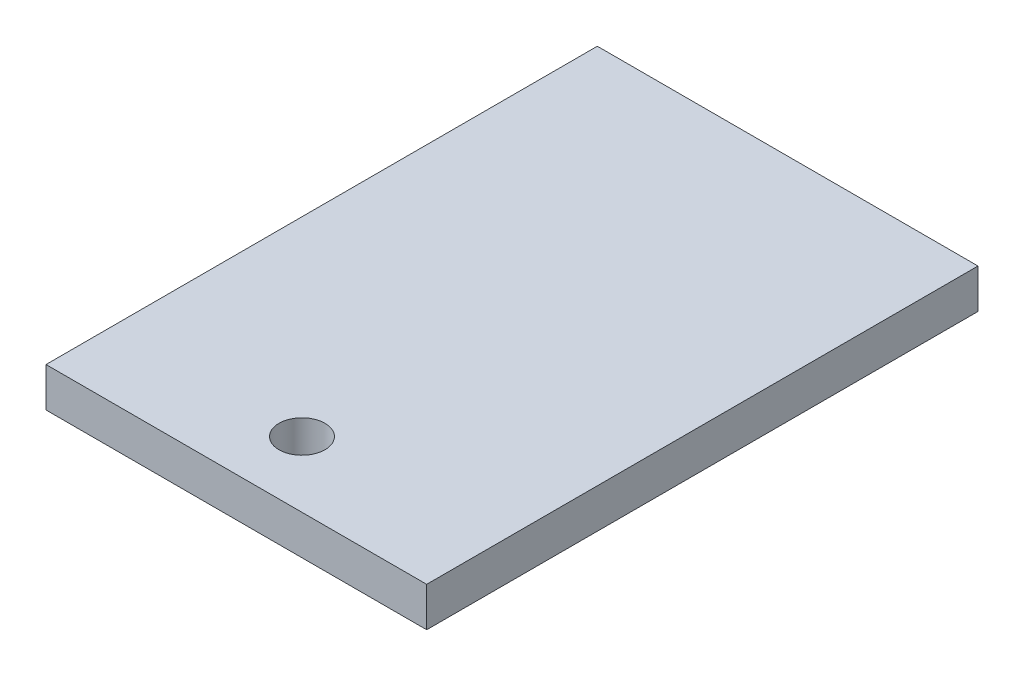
ISO-10303-21;
HEADER;
FILE_DESCRIPTION(('STEP AP214'),'2;1');
FILE_NAME('part.step','',(''),(''),'','','');
FILE_SCHEMA(('AUTOMOTIVE_DESIGN { 1 0 10303 214 1 1 1 1 }'));
ENDSEC;
DATA;
#1=APPLICATION_CONTEXT('core data for automotive mechanical design processes');
#2=APPLICATION_PROTOCOL_DEFINITION('international standard','automotive_design',2000,#1);
#3=PRODUCT_CONTEXT('',#1,'mechanical');
#4=PRODUCT('Part','Part','',(#3));
#5=PRODUCT_RELATED_PRODUCT_CATEGORY('part','',(#4));
#6=PRODUCT_DEFINITION_FORMATION('','',#4);
#7=PRODUCT_DEFINITION_CONTEXT('part definition',#1,'design');
#8=PRODUCT_DEFINITION('design','',#6,#7);
#9=PRODUCT_DEFINITION_SHAPE('','',#8);
#10=(LENGTH_UNIT() NAMED_UNIT(*) SI_UNIT(.MILLI.,.METRE.));
#11=(NAMED_UNIT(*) PLANE_ANGLE_UNIT() SI_UNIT($,.RADIAN.));
#12=(NAMED_UNIT(*) SI_UNIT($,.STERADIAN.) SOLID_ANGLE_UNIT());
#13=UNCERTAINTY_MEASURE_WITH_UNIT(LENGTH_MEASURE(1.E-05),#10,'distance_accuracy_value','');
#14=(GEOMETRIC_REPRESENTATION_CONTEXT(3) GLOBAL_UNCERTAINTY_ASSIGNED_CONTEXT((#13)) GLOBAL_UNIT_ASSIGNED_CONTEXT((#10,
#11,#12)) REPRESENTATION_CONTEXT('',''));
#15=CARTESIAN_POINT('',(0.,0.,0.));
#16=DIRECTION('',(0.,0.,1.));
#17=DIRECTION('',(1.,0.,0.));
#18=AXIS2_PLACEMENT_3D('',#15,#16,#17);
#19=CARTESIAN_POINT('',(0.,3.,-42.));
#20=DIRECTION('',(0.,-1.,0.));
#21=DIRECTION('',(0.,0.,-1.));
#22=AXIS2_PLACEMENT_3D('',#19,#20,#21);
#23=PLANE('',#22);
#24=DIRECTION('',(0.,0.,1.));
#25=VECTOR('',#24,1.);
#26=CARTESIAN_POINT('',(0.,3.,0.));
#27=LINE('',#26,#25);
#28=CARTESIAN_POINT('',(0.,3.,-42.));
#29=VERTEX_POINT('',#28);
#30=CARTESIAN_POINT('',(0.,3.,0.));
#31=VERTEX_POINT('',#30);
#32=EDGE_CURVE('E99',#29,#31,#27,.T.);
#33=ORIENTED_EDGE('',*,*,#32,.T.);
#34=DIRECTION('',(1.,0.,0.));
#35=VECTOR('',#34,1.);
#36=CARTESIAN_POINT('',(0.,3.,0.));
#37=LINE('',#36,#35);
#38=CARTESIAN_POINT('',(29.,3.,0.));
#39=VERTEX_POINT('',#38);
#40=EDGE_CURVE('E84',#31,#39,#37,.T.);
#41=ORIENTED_EDGE('',*,*,#40,.T.);
#42=DIRECTION('',(0.,0.,-1.));
#43=VECTOR('',#42,1.);
#44=CARTESIAN_POINT('',(29.,3.,0.));
#45=LINE('',#44,#43);
#46=CARTESIAN_POINT('',(29.,3.,-42.));
#47=VERTEX_POINT('',#46);
#48=EDGE_CURVE('E50',#39,#47,#45,.T.);
#49=ORIENTED_EDGE('',*,*,#48,.T.);
#50=DIRECTION('',(-1.,0.,0.));
#51=VECTOR('',#50,1.);
#52=CARTESIAN_POINT('',(0.,3.,-42.));
#53=LINE('',#52,#51);
#54=EDGE_CURVE('E45',#47,#29,#53,.T.);
#55=ORIENTED_EDGE('',*,*,#54,.T.);
#56=EDGE_LOOP('',(#33,#41,#49,#55));
#57=FACE_BOUND('',#56,.T.);
#58=CARTESIAN_POINT('',(14.5,3.,-5.));
#59=DIRECTION('',(0.,1.,0.));
#60=DIRECTION('',(0.,0.,1.));
#61=AXIS2_PLACEMENT_3D('',#58,#59,#60);
#62=CIRCLE('',#61,1.75);
#63=CARTESIAN_POINT('',(14.5,3.,-3.25));
#64=VERTEX_POINT('',#63);
#65=EDGE_CURVE('E89',#64,#64,#62,.T.);
#66=ORIENTED_EDGE('',*,*,#65,.F.);
#67=EDGE_LOOP('',(#66));
#68=FACE_BOUND('',#67,.T.);
#69=ADVANCED_FACE('F30',(#57,#68),#23,.F.);
#70=CARTESIAN_POINT('',(0.,0.,-42.));
#71=DIRECTION('',(0.,-1.,0.));
#72=DIRECTION('',(0.,0.,-1.));
#73=AXIS2_PLACEMENT_3D('',#70,#71,#72);
#74=PLANE('',#73);
#75=DIRECTION('',(0.,0.,1.));
#76=VECTOR('',#75,1.);
#77=CARTESIAN_POINT('',(0.,0.,0.));
#78=LINE('',#77,#76);
#79=CARTESIAN_POINT('',(0.,0.,-42.));
#80=VERTEX_POINT('',#79);
#81=CARTESIAN_POINT('',(0.,0.,0.));
#82=VERTEX_POINT('',#81);
#83=EDGE_CURVE('E76',#80,#82,#78,.T.);
#84=ORIENTED_EDGE('',*,*,#83,.F.);
#85=DIRECTION('',(-1.,0.,0.));
#86=VECTOR('',#85,1.);
#87=CARTESIAN_POINT('',(0.,0.,-42.));
#88=LINE('',#87,#86);
#89=CARTESIAN_POINT('',(29.,0.,-42.));
#90=VERTEX_POINT('',#89);
#91=EDGE_CURVE('E97',#90,#80,#88,.T.);
#92=ORIENTED_EDGE('',*,*,#91,.F.);
#93=DIRECTION('',(0.,0.,-1.));
#94=VECTOR('',#93,1.);
#95=CARTESIAN_POINT('',(29.,0.,0.));
#96=LINE('',#95,#94);
#97=CARTESIAN_POINT('',(29.,0.,0.));
#98=VERTEX_POINT('',#97);
#99=EDGE_CURVE('E77',#98,#90,#96,.T.);
#100=ORIENTED_EDGE('',*,*,#99,.F.);
#101=DIRECTION('',(1.,0.,0.));
#102=VECTOR('',#101,1.);
#103=CARTESIAN_POINT('',(0.,0.,0.));
#104=LINE('',#103,#102);
#105=EDGE_CURVE('E71',#82,#98,#104,.T.);
#106=ORIENTED_EDGE('',*,*,#105,.F.);
#107=EDGE_LOOP('',(#84,#92,#100,#106));
#108=FACE_BOUND('',#107,.T.);
#109=CARTESIAN_POINT('',(14.5,0.,-5.));
#110=DIRECTION('',(0.,1.,0.));
#111=DIRECTION('',(0.,0.,1.));
#112=AXIS2_PLACEMENT_3D('',#109,#110,#111);
#113=CIRCLE('',#112,1.75);
#114=CARTESIAN_POINT('',(14.5,0.,-3.25));
#115=VERTEX_POINT('',#114);
#116=EDGE_CURVE('E92',#115,#115,#113,.T.);
#117=ORIENTED_EDGE('',*,*,#116,.T.);
#118=EDGE_LOOP('',(#117));
#119=FACE_BOUND('',#118,.T.);
#120=ADVANCED_FACE('F72',(#108,#119),#74,.T.);
#121=CARTESIAN_POINT('',(0.,3.,0.));
#122=DIRECTION('',(1.,0.,0.));
#123=DIRECTION('',(0.,0.,-1.));
#124=AXIS2_PLACEMENT_3D('',#121,#122,#123);
#125=PLANE('',#124);
#126=ORIENTED_EDGE('',*,*,#83,.T.);
#127=DIRECTION('',(0.,-1.,0.));
#128=VECTOR('',#127,1.);
#129=CARTESIAN_POINT('',(0.,3.,0.));
#130=LINE('',#129,#128);
#131=EDGE_CURVE('E11',#31,#82,#130,.T.);
#132=ORIENTED_EDGE('',*,*,#131,.F.);
#133=ORIENTED_EDGE('',*,*,#32,.F.);
#134=DIRECTION('',(0.,-1.,0.));
#135=VECTOR('',#134,1.);
#136=CARTESIAN_POINT('',(0.,3.,-42.));
#137=LINE('',#136,#135);
#138=EDGE_CURVE('E88',#29,#80,#137,.T.);
#139=ORIENTED_EDGE('',*,*,#138,.T.);
#140=EDGE_LOOP('',(#126,#132,#133,#139));
#141=FACE_BOUND('',#140,.T.);
#142=ADVANCED_FACE('F32',(#141),#125,.F.);
#143=CARTESIAN_POINT('',(0.,3.,0.));
#144=DIRECTION('',(0.,0.,-1.));
#145=DIRECTION('',(-1.,0.,0.));
#146=AXIS2_PLACEMENT_3D('',#143,#144,#145);
#147=PLANE('',#146);
#148=ORIENTED_EDGE('',*,*,#105,.T.);
#149=DIRECTION('',(0.,-1.,0.));
#150=VECTOR('',#149,1.);
#151=CARTESIAN_POINT('',(29.,3.,0.));
#152=LINE('',#151,#150);
#153=EDGE_CURVE('E38',#39,#98,#152,.T.);
#154=ORIENTED_EDGE('',*,*,#153,.F.);
#155=ORIENTED_EDGE('',*,*,#40,.F.);
#156=ORIENTED_EDGE('',*,*,#131,.T.);
#157=EDGE_LOOP('',(#148,#154,#155,#156));
#158=FACE_BOUND('',#157,.T.);
#159=ADVANCED_FACE('F83',(#158),#147,.F.);
#160=CARTESIAN_POINT('',(29.,3.,0.));
#161=DIRECTION('',(-1.,0.,0.));
#162=DIRECTION('',(0.,0.,1.));
#163=AXIS2_PLACEMENT_3D('',#160,#161,#162);
#164=PLANE('',#163);
#165=ORIENTED_EDGE('',*,*,#99,.T.);
#166=DIRECTION('',(0.,-1.,0.));
#167=VECTOR('',#166,1.);
#168=CARTESIAN_POINT('',(29.,3.,-42.));
#169=LINE('',#168,#167);
#170=EDGE_CURVE('E105',#47,#90,#169,.T.);
#171=ORIENTED_EDGE('',*,*,#170,.F.);
#172=ORIENTED_EDGE('',*,*,#48,.F.);
#173=ORIENTED_EDGE('',*,*,#153,.T.);
#174=EDGE_LOOP('',(#165,#171,#172,#173));
#175=FACE_BOUND('',#174,.T.);
#176=ADVANCED_FACE('F108',(#175),#164,.F.);
#177=CARTESIAN_POINT('',(0.,3.,-42.));
#178=DIRECTION('',(0.,0.,1.));
#179=DIRECTION('',(1.,0.,0.));
#180=AXIS2_PLACEMENT_3D('',#177,#178,#179);
#181=PLANE('',#180);
#182=ORIENTED_EDGE('',*,*,#91,.T.);
#183=ORIENTED_EDGE('',*,*,#138,.F.);
#184=ORIENTED_EDGE('',*,*,#54,.F.);
#185=ORIENTED_EDGE('',*,*,#170,.T.);
#186=EDGE_LOOP('',(#182,#183,#184,#185));
#187=FACE_BOUND('',#186,.T.);
#188=ADVANCED_FACE('F110',(#187),#181,.F.);
#189=CARTESIAN_POINT('',(14.5,3.,-5.));
#190=DIRECTION('',(0.,-1.,0.));
#191=DIRECTION('',(0.,0.,-1.));
#192=AXIS2_PLACEMENT_3D('',#189,#190,#191);
#193=CYLINDRICAL_SURFACE('',#192,1.75);
#194=ORIENTED_EDGE('',*,*,#65,.T.);
#195=EDGE_LOOP('',(#194));
#196=FACE_BOUND('',#195,.T.);
#197=ORIENTED_EDGE('',*,*,#116,.F.);
#198=EDGE_LOOP('',(#197));
#199=FACE_BOUND('',#198,.T.);
#200=ADVANCED_FACE('F116',(#196,#199),#193,.F.);
#201=CLOSED_SHELL('',(#69,#120,#142,#159,#176,#188,#200));
#202=MANIFOLD_SOLID_BREP('B2',#201);
#203=ADVANCED_BREP_SHAPE_REPRESENTATION('',(#18,#202),#14);
#204=SHAPE_DEFINITION_REPRESENTATION(#9,#203);
ENDSEC;
END-ISO-10303-21;
